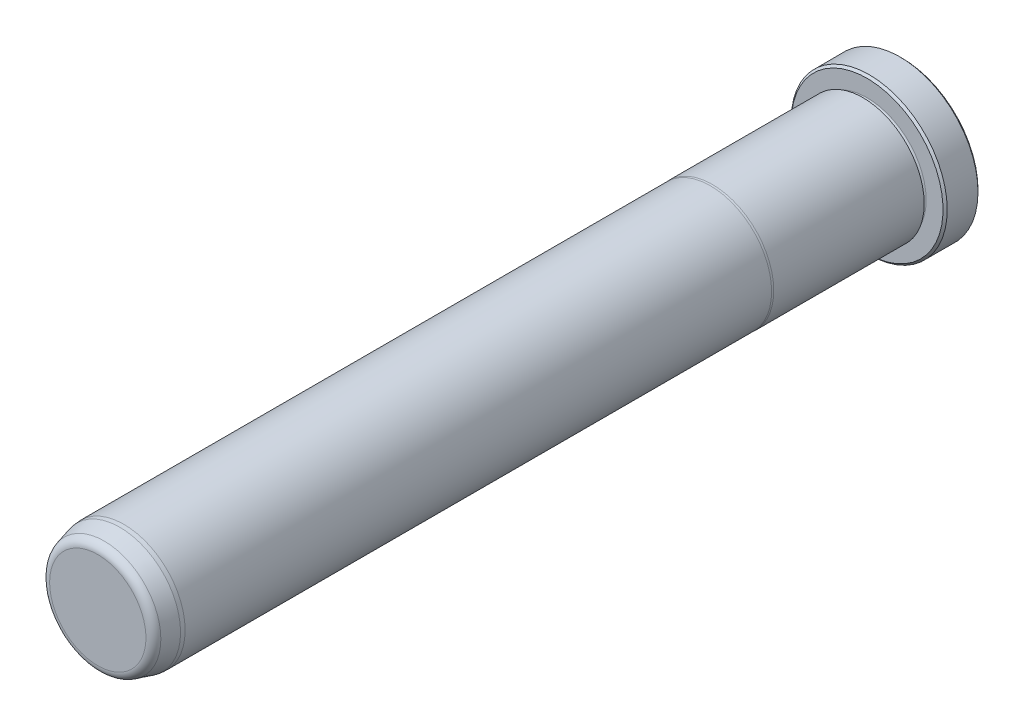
ISO-10303-21;
HEADER;
FILE_DESCRIPTION(('STEP AP214'),'2;1');
FILE_NAME('part.step','',(''),(''),'','','');
FILE_SCHEMA(('AUTOMOTIVE_DESIGN { 1 0 10303 214 1 1 1 1 }'));
ENDSEC;
DATA;
#1=APPLICATION_CONTEXT('core data for automotive mechanical design processes');
#2=APPLICATION_PROTOCOL_DEFINITION('international standard','automotive_design',2000,#1);
#3=PRODUCT_CONTEXT('',#1,'mechanical');
#4=PRODUCT('Part','Part','',(#3));
#5=PRODUCT_RELATED_PRODUCT_CATEGORY('part','',(#4));
#6=PRODUCT_DEFINITION_FORMATION('','',#4);
#7=PRODUCT_DEFINITION_CONTEXT('part definition',#1,'design');
#8=PRODUCT_DEFINITION('design','',#6,#7);
#9=PRODUCT_DEFINITION_SHAPE('','',#8);
#10=(LENGTH_UNIT() NAMED_UNIT(*) SI_UNIT(.MILLI.,.METRE.));
#11=(NAMED_UNIT(*) PLANE_ANGLE_UNIT() SI_UNIT($,.RADIAN.));
#12=(NAMED_UNIT(*) SI_UNIT($,.STERADIAN.) SOLID_ANGLE_UNIT());
#13=UNCERTAINTY_MEASURE_WITH_UNIT(LENGTH_MEASURE(1.E-05),#10,'distance_accuracy_value','');
#14=(GEOMETRIC_REPRESENTATION_CONTEXT(3) GLOBAL_UNCERTAINTY_ASSIGNED_CONTEXT((#13)) GLOBAL_UNIT_ASSIGNED_CONTEXT((#10,
#11,#12)) REPRESENTATION_CONTEXT('',''));
#15=CARTESIAN_POINT('',(0.,0.,0.));
#16=DIRECTION('',(0.,0.,1.));
#17=DIRECTION('',(1.,0.,0.));
#18=AXIS2_PLACEMENT_3D('',#15,#16,#17);
#19=CARTESIAN_POINT('',(0.,0.,0.));
#20=DIRECTION('',(0.,0.,1.));
#21=DIRECTION('',(1.,0.,0.));
#22=AXIS2_PLACEMENT_3D('',#19,#20,#21);
#23=PLANE('',#22);
#24=CARTESIAN_POINT('',(0.,0.,0.));
#25=DIRECTION('',(0.,0.,1.));
#26=DIRECTION('',(1.,0.,0.));
#27=AXIS2_PLACEMENT_3D('',#24,#25,#26);
#28=CIRCLE('',#27,13.7795);
#29=CARTESIAN_POINT('',(13.7795,0.,0.));
#30=VERTEX_POINT('',#29);
#31=EDGE_CURVE('E37',#30,#30,#28,.F.);
#32=ORIENTED_EDGE('',*,*,#31,.T.);
#33=EDGE_LOOP('',(#32));
#34=FACE_BOUND('',#33,.T.);
#35=ADVANCED_FACE('F30',(#34),#23,.F.);
#36=CARTESIAN_POINT('',(0.,0.,0.));
#37=DIRECTION('',(0.,0.,1.));
#38=DIRECTION('',(1.,0.,0.));
#39=AXIS2_PLACEMENT_3D('',#36,#37,#38);
#40=CYLINDRICAL_SURFACE('',#39,14.1605);
#41=CARTESIAN_POINT('',(0.,0.,0.381000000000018));
#42=DIRECTION('',(0.,0.,1.));
#43=DIRECTION('',(1.,0.,0.));
#44=AXIS2_PLACEMENT_3D('',#41,#42,#43);
#45=CIRCLE('',#44,14.1605);
#46=CARTESIAN_POINT('',(14.1605,0.,0.381000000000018));
#47=VERTEX_POINT('',#46);
#48=EDGE_CURVE('E41',#47,#47,#45,.T.);
#49=ORIENTED_EDGE('',*,*,#48,.T.);
#50=EDGE_LOOP('',(#49));
#51=FACE_BOUND('',#50,.T.);
#52=CARTESIAN_POINT('',(0.,0.,5.96900000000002));
#53=DIRECTION('',(0.,0.,-1.));
#54=DIRECTION('',(-1.,0.,0.));
#55=AXIS2_PLACEMENT_3D('',#52,#53,#54);
#56=CIRCLE('',#55,14.1605);
#57=CARTESIAN_POINT('',(-14.1605,0.,5.96900000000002));
#58=VERTEX_POINT('',#57);
#59=EDGE_CURVE('E45',#58,#58,#56,.T.);
#60=ORIENTED_EDGE('',*,*,#59,.T.);
#61=EDGE_LOOP('',(#60));
#62=FACE_BOUND('',#61,.T.);
#63=ADVANCED_FACE('F118',(#51,#62),#40,.T.);
#64=CARTESIAN_POINT('',(0.,14.1605,6.35));
#65=DIRECTION('',(0.,0.,-1.));
#66=DIRECTION('',(-1.,0.,0.));
#67=AXIS2_PLACEMENT_3D('',#64,#65,#66);
#68=PLANE('',#67);
#69=CARTESIAN_POINT('',(0.,0.,6.35));
#70=DIRECTION('',(0.,0.,-1.));
#71=DIRECTION('',(-1.,0.,0.));
#72=AXIS2_PLACEMENT_3D('',#69,#70,#71);
#73=CIRCLE('',#72,13.7795);
#74=CARTESIAN_POINT('',(-13.7795,0.,6.35));
#75=VERTEX_POINT('',#74);
#76=EDGE_CURVE('E10',#75,#75,#73,.F.);
#77=ORIENTED_EDGE('',*,*,#76,.T.);
#78=EDGE_LOOP('',(#77));
#79=FACE_BOUND('',#78,.T.);
#80=CARTESIAN_POINT('',(0.,0.,6.35));
#81=DIRECTION('',(0.,0.,1.));
#82=DIRECTION('',(1.,0.,0.));
#83=AXIS2_PLACEMENT_3D('',#80,#81,#82);
#84=CIRCLE('',#83,10.7188);
#85=CARTESIAN_POINT('',(10.7188,0.,6.35));
#86=VERTEX_POINT('',#85);
#87=EDGE_CURVE('E56',#86,#86,#84,.T.);
#88=ORIENTED_EDGE('',*,*,#87,.F.);
#89=EDGE_LOOP('',(#88));
#90=FACE_BOUND('',#89,.T.);
#91=ADVANCED_FACE('F113',(#79,#90),#68,.F.);
#92=CARTESIAN_POINT('',(0.,0.,6.731));
#93=DIRECTION('',(0.,0.,1.));
#94=DIRECTION('',(1.,0.,0.));
#95=AXIS2_PLACEMENT_3D('',#92,#93,#94);
#96=TOROIDAL_SURFACE('',#95,10.7188,0.381000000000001);
#97=CARTESIAN_POINT('',(0.,0.,7.112));
#98=DIRECTION('',(0.,0.,1.));
#99=DIRECTION('',(1.,0.,0.));
#100=AXIS2_PLACEMENT_3D('',#97,#98,#99);
#101=CIRCLE('',#100,10.7188);
#102=CARTESIAN_POINT('',(10.7188,0.,7.112));
#103=VERTEX_POINT('',#102);
#104=EDGE_CURVE('E59',#103,#103,#101,.T.);
#105=ORIENTED_EDGE('',*,*,#104,.F.);
#106=EDGE_LOOP('',(#105));
#107=FACE_BOUND('',#106,.T.);
#108=ORIENTED_EDGE('',*,*,#87,.T.);
#109=EDGE_LOOP('',(#108));
#110=FACE_BOUND('',#109,.T.);
#111=ADVANCED_FACE('F107',(#107,#110),#96,.F.);
#112=CARTESIAN_POINT('',(0.,10.7188,7.112));
#113=DIRECTION('',(0.,0.,1.));
#114=DIRECTION('',(1.,0.,0.));
#115=AXIS2_PLACEMENT_3D('',#112,#113,#114);
#116=PLANE('',#115);
#117=CARTESIAN_POINT('',(0.,0.,7.112));
#118=DIRECTION('',(0.,0.,1.));
#119=DIRECTION('',(1.,0.,0.));
#120=AXIS2_PLACEMENT_3D('',#117,#118,#119);
#121=CIRCLE('',#120,11.1252);
#122=CARTESIAN_POINT('',(11.1252,0.,7.112));
#123=VERTEX_POINT('',#122);
#124=EDGE_CURVE('E62',#123,#123,#121,.T.);
#125=ORIENTED_EDGE('',*,*,#124,.F.);
#126=EDGE_LOOP('',(#125));
#127=FACE_BOUND('',#126,.T.);
#128=ORIENTED_EDGE('',*,*,#104,.T.);
#129=EDGE_LOOP('',(#128));
#130=FACE_BOUND('',#129,.T.);
#131=ADVANCED_FACE('F101',(#127,#130),#116,.F.);
#132=CARTESIAN_POINT('',(0.,0.,0.));
#133=DIRECTION('',(0.,0.,1.));
#134=DIRECTION('',(1.,0.,0.));
#135=AXIS2_PLACEMENT_3D('',#132,#133,#134);
#136=CYLINDRICAL_SURFACE('',#135,11.1252);
#137=CARTESIAN_POINT('',(0.,0.,34.4347630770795));
#138=DIRECTION('',(0.,0.,1.));
#139=DIRECTION('',(1.,0.,0.));
#140=AXIS2_PLACEMENT_3D('',#137,#138,#139);
#141=CIRCLE('',#140,11.1252);
#142=CARTESIAN_POINT('',(11.1252,0.,34.4347630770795));
#143=VERTEX_POINT('',#142);
#144=EDGE_CURVE('E65',#143,#143,#141,.T.);
#145=ORIENTED_EDGE('',*,*,#144,.F.);
#146=EDGE_LOOP('',(#145));
#147=FACE_BOUND('',#146,.T.);
#148=ORIENTED_EDGE('',*,*,#124,.T.);
#149=EDGE_LOOP('',(#148));
#150=FACE_BOUND('',#149,.T.);
#151=ADVANCED_FACE('F95',(#147,#150),#136,.T.);
#152=CARTESIAN_POINT('',(0.,0.,34.4347630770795));
#153=DIRECTION('',(0.,0.,-1.));
#154=DIRECTION('',(-1.,0.,0.));
#155=AXIS2_PLACEMENT_3D('',#152,#153,#154);
#156=CONICAL_SURFACE('',#155,11.1252,0.0698131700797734);
#157=CARTESIAN_POINT('',(0.,0.,34.798));
#158=DIRECTION('',(0.,0.,1.));
#159=DIRECTION('',(1.,0.,0.));
#160=AXIS2_PLACEMENT_3D('',#157,#158,#159);
#161=CIRCLE('',#160,11.0998);
#162=CARTESIAN_POINT('',(11.0998,0.,34.798));
#163=VERTEX_POINT('',#162);
#164=EDGE_CURVE('E68',#163,#163,#161,.T.);
#165=ORIENTED_EDGE('',*,*,#164,.F.);
#166=EDGE_LOOP('',(#165));
#167=FACE_BOUND('',#166,.T.);
#168=ORIENTED_EDGE('',*,*,#144,.T.);
#169=EDGE_LOOP('',(#168));
#170=FACE_BOUND('',#169,.T.);
#171=ADVANCED_FACE('F89',(#167,#170),#156,.T.);
#172=CARTESIAN_POINT('',(0.,0.,0.));
#173=DIRECTION('',(0.,0.,1.));
#174=DIRECTION('',(1.,0.,0.));
#175=AXIS2_PLACEMENT_3D('',#172,#173,#174);
#176=CYLINDRICAL_SURFACE('',#175,11.0998);
#177=CARTESIAN_POINT('',(0.,0.,141.2875));
#178=DIRECTION('',(0.,0.,1.));
#179=DIRECTION('',(1.,0.,0.));
#180=AXIS2_PLACEMENT_3D('',#177,#178,#179);
#181=CIRCLE('',#180,11.0998);
#182=CARTESIAN_POINT('',(11.0998,0.,141.2875));
#183=VERTEX_POINT('',#182);
#184=EDGE_CURVE('E71',#183,#183,#181,.T.);
#185=ORIENTED_EDGE('',*,*,#184,.F.);
#186=EDGE_LOOP('',(#185));
#187=FACE_BOUND('',#186,.T.);
#188=ORIENTED_EDGE('',*,*,#164,.T.);
#189=EDGE_LOOP('',(#188));
#190=FACE_BOUND('',#189,.T.);
#191=ADVANCED_FACE('F83',(#187,#190),#176,.T.);
#192=CARTESIAN_POINT('',(0.,0.,141.2875));
#193=DIRECTION('',(0.,0.,-1.));
#194=DIRECTION('',(-1.,0.,0.));
#195=AXIS2_PLACEMENT_3D('',#192,#193,#194);
#196=CONICAL_SURFACE('',#195,11.0998,0.0872664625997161);
#197=CARTESIAN_POINT('',(0.,0.,142.0495));
#198=DIRECTION('',(0.,0.,1.));
#199=DIRECTION('',(1.,0.,0.));
#200=AXIS2_PLACEMENT_3D('',#197,#198,#199);
#201=CIRCLE('',#200,11.0331336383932);
#202=CARTESIAN_POINT('',(11.0331336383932,0.,142.0495));
#203=VERTEX_POINT('',#202);
#204=EDGE_CURVE('E74',#203,#203,#201,.T.);
#205=ORIENTED_EDGE('',*,*,#204,.F.);
#206=EDGE_LOOP('',(#205));
#207=FACE_BOUND('',#206,.T.);
#208=ORIENTED_EDGE('',*,*,#184,.T.);
#209=EDGE_LOOP('',(#208));
#210=FACE_BOUND('',#209,.T.);
#211=ADVANCED_FACE('F80',(#207,#210),#196,.T.);
#212=CARTESIAN_POINT('',(0.,0.,142.0495));
#213=DIRECTION('',(0.,0.,-1.));
#214=DIRECTION('',(-1.,0.,0.));
#215=AXIS2_PLACEMENT_3D('',#212,#213,#214);
#216=CONICAL_SURFACE('',#215,11.0331336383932,0.26179938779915);
#217=CARTESIAN_POINT('',(0.,0.,144.8733752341));
#218=DIRECTION('',(0.,0.,1.));
#219=DIRECTION('',(1.,0.,0.));
#220=AXIS2_PLACEMENT_3D('',#217,#218,#219);
#221=CIRCLE('',#220,10.2764785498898);
#222=CARTESIAN_POINT('',(10.2764785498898,0.,144.8733752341));
#223=VERTEX_POINT('',#222);
#224=EDGE_CURVE('E50',#223,#223,#221,.F.);
#225=ORIENTED_EDGE('',*,*,#224,.T.);
#226=EDGE_LOOP('',(#225));
#227=FACE_BOUND('',#226,.T.);
#228=ORIENTED_EDGE('',*,*,#204,.T.);
#229=EDGE_LOOP('',(#228));
#230=FACE_BOUND('',#229,.T.);
#231=ADVANCED_FACE('F78',(#227,#230),#216,.T.);
#232=CARTESIAN_POINT('',(0.,9.96120289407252,146.05));
#233=DIRECTION('',(0.,0.,-1.));
#234=DIRECTION('',(-1.,0.,0.));
#235=AXIS2_PLACEMENT_3D('',#232,#233,#234);
#236=PLANE('',#235);
#237=CARTESIAN_POINT('',(0.,0.,146.05));
#238=DIRECTION('',(0.,0.,-1.));
#239=DIRECTION('',(-1.,0.,0.));
#240=AXIS2_PLACEMENT_3D('',#237,#238,#239);
#241=CIRCLE('',#240,8.74307130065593);
#242=CARTESIAN_POINT('',(-8.74307130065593,0.,146.05));
#243=VERTEX_POINT('',#242);
#244=EDGE_CURVE('E53',#243,#243,#241,.F.);
#245=ORIENTED_EDGE('',*,*,#244,.T.);
#246=EDGE_LOOP('',(#245));
#247=FACE_BOUND('',#246,.T.);
#248=ADVANCED_FACE('F133',(#247),#236,.F.);
#249=CARTESIAN_POINT('',(0.,0.,144.4625));
#250=DIRECTION('',(0.,0.,-1.));
#251=DIRECTION('',(-1.,0.,0.));
#252=AXIS2_PLACEMENT_3D('',#249,#250,#251);
#253=TOROIDAL_SURFACE('',#252,8.74307130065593,1.5875);
#254=ORIENTED_EDGE('',*,*,#224,.F.);
#255=EDGE_LOOP('',(#254));
#256=FACE_BOUND('',#255,.T.);
#257=ORIENTED_EDGE('',*,*,#244,.F.);
#258=EDGE_LOOP('',(#257));
#259=FACE_BOUND('',#258,.T.);
#260=ADVANCED_FACE('F130',(#256,#259),#253,.T.);
#261=CARTESIAN_POINT('',(0.,0.,0.381000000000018));
#262=DIRECTION('',(0.,0.,1.));
#263=DIRECTION('',(1.,0.,0.));
#264=AXIS2_PLACEMENT_3D('',#261,#262,#263);
#265=CONICAL_SURFACE('',#264,14.1605,0.785398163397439);
#266=CARTESIAN_POINT('',(13.7795,0.,0.));
#267=CARTESIAN_POINT('',(13.78346875,0.,0.00396875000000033));
#268=CARTESIAN_POINT('',(13.7874375,0.,0.00793750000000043));
#269=CARTESIAN_POINT('',(13.795375,0.,0.0158750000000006));
#270=CARTESIAN_POINT('',(13.79934375,0.,0.0198437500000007));
#271=CARTESIAN_POINT('',(13.80728125,0.,0.0277812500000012));
#272=CARTESIAN_POINT('',(13.81125,0.,0.0317500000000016));
#273=CARTESIAN_POINT('',(13.8191875,0.,0.039687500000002));
#274=CARTESIAN_POINT('',(13.82315625,0.,0.0436562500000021));
#275=CARTESIAN_POINT('',(13.83109375,0.,0.0515937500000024));
#276=CARTESIAN_POINT('',(13.8350625,0.,0.0555625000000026));
#277=CARTESIAN_POINT('',(13.843,0.,0.063500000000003));
#278=CARTESIAN_POINT('',(13.84696875,0.,0.0674687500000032));
#279=CARTESIAN_POINT('',(13.85490625,0.,0.0754062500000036));
#280=CARTESIAN_POINT('',(13.858875,0.,0.0793750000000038));
#281=CARTESIAN_POINT('',(13.8668125,0.,0.0873125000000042));
#282=CARTESIAN_POINT('',(13.87078125,0.,0.0912812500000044));
#283=CARTESIAN_POINT('',(13.87871875,0.,0.0992187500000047));
#284=CARTESIAN_POINT('',(13.8826875,0.,0.103187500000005));
#285=CARTESIAN_POINT('',(13.890625,0.,0.111125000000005));
#286=CARTESIAN_POINT('',(13.89459375,0.,0.115093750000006));
#287=CARTESIAN_POINT('',(13.90253125,0.,0.123031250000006));
#288=CARTESIAN_POINT('',(13.9065,0.,0.127000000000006));
#289=CARTESIAN_POINT('',(13.9144375,0.,0.134937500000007));
#290=CARTESIAN_POINT('',(13.91840625,0.,0.138906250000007));
#291=CARTESIAN_POINT('',(13.92634375,0.,0.146843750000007));
#292=CARTESIAN_POINT('',(13.9303125,0.,0.150812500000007));
#293=CARTESIAN_POINT('',(13.93825,0.,0.158750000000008));
#294=CARTESIAN_POINT('',(13.94221875,0.,0.162718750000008));
#295=CARTESIAN_POINT('',(13.95015625,0.,0.170656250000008));
#296=CARTESIAN_POINT('',(13.954125,0.,0.174625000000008));
#297=CARTESIAN_POINT('',(13.9620625,0.,0.182562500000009));
#298=CARTESIAN_POINT('',(13.96603125,0.,0.186531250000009));
#299=CARTESIAN_POINT('',(13.97396875,0.,0.19446875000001));
#300=CARTESIAN_POINT('',(13.9779375,0.,0.19843750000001));
#301=CARTESIAN_POINT('',(13.985875,0.,0.20637500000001));
#302=CARTESIAN_POINT('',(13.98984375,0.,0.21034375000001));
#303=CARTESIAN_POINT('',(13.99778125,0.,0.218281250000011));
#304=CARTESIAN_POINT('',(14.00175,0.,0.222250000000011));
#305=CARTESIAN_POINT('',(14.0096875,0.,0.230187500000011));
#306=CARTESIAN_POINT('',(14.01365625,0.,0.234156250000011));
#307=CARTESIAN_POINT('',(14.02159375,0.,0.242093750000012));
#308=CARTESIAN_POINT('',(14.0255625,0.,0.246062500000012));
#309=CARTESIAN_POINT('',(14.0335,0.,0.254000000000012));
#310=CARTESIAN_POINT('',(14.03746875,0.,0.257968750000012));
#311=CARTESIAN_POINT('',(14.04540625,0.,0.265906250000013));
#312=CARTESIAN_POINT('',(14.049375,0.,0.269875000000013));
#313=CARTESIAN_POINT('',(14.0573125,0.,0.277812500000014));
#314=CARTESIAN_POINT('',(14.06128125,0.,0.281781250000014));
#315=CARTESIAN_POINT('',(14.06921875,0.,0.289718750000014));
#316=CARTESIAN_POINT('',(14.0731875,0.,0.293687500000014));
#317=CARTESIAN_POINT('',(14.081125,0.,0.301625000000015));
#318=CARTESIAN_POINT('',(14.08509375,0.,0.305593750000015));
#319=CARTESIAN_POINT('',(14.09303125,0.,0.313531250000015));
#320=CARTESIAN_POINT('',(14.097,0.,0.317500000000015));
#321=CARTESIAN_POINT('',(14.1049375,0.,0.325437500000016));
#322=CARTESIAN_POINT('',(14.10890625,0.,0.329406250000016));
#323=CARTESIAN_POINT('',(14.11684375,0.,0.337343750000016));
#324=CARTESIAN_POINT('',(14.1208125,0.,0.341312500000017));
#325=CARTESIAN_POINT('',(14.12875,0.,0.349250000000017));
#326=CARTESIAN_POINT('',(14.13271875,0.,0.353218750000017));
#327=CARTESIAN_POINT('',(14.14065625,0.,0.361156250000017));
#328=CARTESIAN_POINT('',(14.144625,0.,0.365125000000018));
#329=CARTESIAN_POINT('',(14.1525625,0.,0.373062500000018));
#330=CARTESIAN_POINT('',(14.15653125,0.,0.377031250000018));
#331=CARTESIAN_POINT('',(14.1605,0.,0.381000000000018));
#332=B_SPLINE_CURVE_WITH_KNOTS('',3,(#266,#267,#268,#269,#270,#271,#272,#273,#274,#275,#276,
#277,#278,#279,#280,#281,#282,#283,#284,#285,#286,#287,#288,#289,#290,#291,#292,#293,#294,#295,
#296,#297,#298,#299,#300,#301,#302,#303,#304,#305,#306,#307,#308,#309,#310,#311,#312,#313,#314,
#315,#316,#317,#318,#319,#320,#321,#322,#323,#324,#325,#326,#327,#328,#329,#330,#331),
.UNSPECIFIED.,.F.,.F.,(4,2,2,2,2,2,2,2,2,2,2,2,2,2,2,2,2,2,2,2,2,2,2,2,2,2,2,2,2,2,2,2,4),(0.,
0.0168379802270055,0.033675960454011,0.0505139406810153,0.0673519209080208,0.0841899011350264,
0.101027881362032,0.117865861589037,0.134703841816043,0.151541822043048,0.168379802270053,
0.185217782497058,0.202055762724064,0.218893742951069,0.235731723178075,0.25256970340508,
0.269407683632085,0.28624566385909,0.303083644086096,0.319921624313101,0.336759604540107,
0.353597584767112,0.370435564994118,0.387273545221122,0.404111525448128,0.420949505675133,
0.437787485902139,0.454625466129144,0.47146344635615,0.488301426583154,0.505139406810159,
0.521977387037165,0.53881536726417),.UNSPECIFIED.);
#333=EDGE_CURVE('BSEAM132',#30,#47,#332,.T.);
#334=ORIENTED_EDGE('',*,*,#31,.F.);
#335=ORIENTED_EDGE('',*,*,#48,.F.);
#336=ORIENTED_EDGE('',*,*,#333,.T.);
#337=ORIENTED_EDGE('',*,*,#333,.F.);
#338=EDGE_LOOP('',(#334,#336,#335,#337));
#339=FACE_BOUND('',#338,.T.);
#340=ADVANCED_FACE('F132',(#339),#265,.T.);
#341=CARTESIAN_POINT('',(0.,0.,6.35));
#342=DIRECTION('',(0.,0.,-1.));
#343=DIRECTION('',(-1.,0.,0.));
#344=AXIS2_PLACEMENT_3D('',#341,#342,#343);
#345=CONICAL_SURFACE('',#344,13.7795,0.785398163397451);
#346=ORIENTED_EDGE('',*,*,#59,.F.);
#347=EDGE_LOOP('',(#346));
#348=FACE_BOUND('',#347,.T.);
#349=ORIENTED_EDGE('',*,*,#76,.F.);
#350=EDGE_LOOP('',(#349));
#351=FACE_BOUND('',#350,.T.);
#352=ADVANCED_FACE('F32',(#348,#351),#345,.T.);
#353=CLOSED_SHELL('',(#35,#63,#91,#111,#131,#151,#171,#191,#211,#231,#248,#260,#340,#352));
#354=MANIFOLD_SOLID_BREP('B2',#353);
#355=ADVANCED_BREP_SHAPE_REPRESENTATION('',(#18,#354),#14);
#356=SHAPE_DEFINITION_REPRESENTATION(#9,#355);
ENDSEC;
END-ISO-10303-21;
